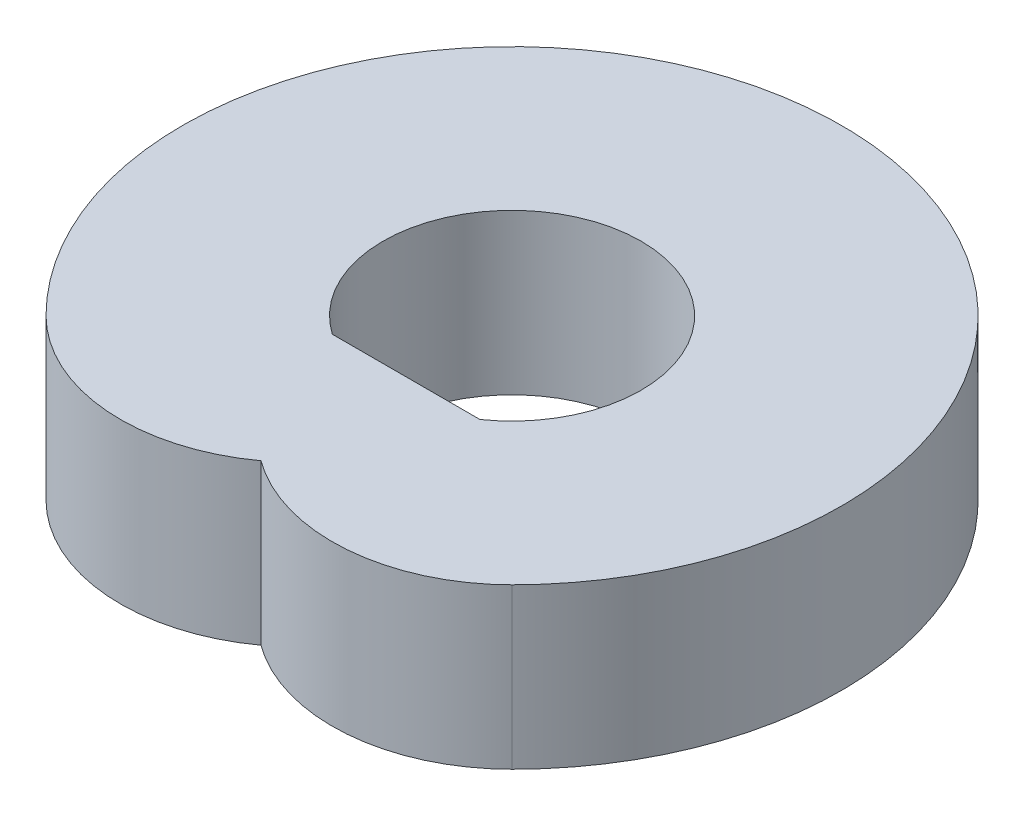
ISO-10303-21;
HEADER;
FILE_DESCRIPTION(('STEP AP214'),'2;1');
FILE_NAME('part.step','',(''),(''),'','','');
FILE_SCHEMA(('AUTOMOTIVE_DESIGN { 1 0 10303 214 1 1 1 1 }'));
ENDSEC;
DATA;
#1=APPLICATION_CONTEXT('core data for automotive mechanical design processes');
#2=APPLICATION_PROTOCOL_DEFINITION('international standard','automotive_design',2000,#1);
#3=PRODUCT_CONTEXT('',#1,'mechanical');
#4=PRODUCT('Part','Part','',(#3));
#5=PRODUCT_RELATED_PRODUCT_CATEGORY('part','',(#4));
#6=PRODUCT_DEFINITION_FORMATION('','',#4);
#7=PRODUCT_DEFINITION_CONTEXT('part definition',#1,'design');
#8=PRODUCT_DEFINITION('design','',#6,#7);
#9=PRODUCT_DEFINITION_SHAPE('','',#8);
#10=(LENGTH_UNIT() NAMED_UNIT(*) SI_UNIT(.MILLI.,.METRE.));
#11=(NAMED_UNIT(*) PLANE_ANGLE_UNIT() SI_UNIT($,.RADIAN.));
#12=(NAMED_UNIT(*) SI_UNIT($,.STERADIAN.) SOLID_ANGLE_UNIT());
#13=UNCERTAINTY_MEASURE_WITH_UNIT(LENGTH_MEASURE(1.E-05),#10,'distance_accuracy_value','');
#14=(GEOMETRIC_REPRESENTATION_CONTEXT(3) GLOBAL_UNCERTAINTY_ASSIGNED_CONTEXT((#13)) GLOBAL_UNIT_ASSIGNED_CONTEXT((#10,
#11,#12)) REPRESENTATION_CONTEXT('',''));
#15=CARTESIAN_POINT('',(0.,0.,0.));
#16=DIRECTION('',(0.,0.,1.));
#17=DIRECTION('',(1.,0.,0.));
#18=AXIS2_PLACEMENT_3D('',#15,#16,#17);
#19=CARTESIAN_POINT('',(132.582521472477,400.,132.582521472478));
#20=DIRECTION('',(0.,1.,0.));
#21=DIRECTION('',(0.,0.,1.));
#22=AXIS2_PLACEMENT_3D('',#19,#20,#21);
#23=PLANE('',#22);
#24=CARTESIAN_POINT('',(265.165042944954,400.,265.165042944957));
#25=DIRECTION('',(0.,1.,0.));
#26=DIRECTION('',(0.,0.,1.));
#27=AXIS2_PLACEMENT_3D('',#24,#25,#26);
#28=CIRCLE('',#27,449.999999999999);
#29=CARTESIAN_POINT('',(1.83186799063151E-12,400.,628.741032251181));
#30=VERTEX_POINT('',#29);
#31=CARTESIAN_POINT('',(583.363094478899,400.,583.363094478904));
#32=VERTEX_POINT('',#31);
#33=EDGE_CURVE('E98',#30,#32,#28,.T.);
#34=ORIENTED_EDGE('',*,*,#33,.T.);
#35=CARTESIAN_POINT('',(0.,400.,0.));
#36=DIRECTION('',(0.,1.,0.));
#37=DIRECTION('',(0.,0.,1.));
#38=AXIS2_PLACEMENT_3D('',#35,#36,#37);
#39=CIRCLE('',#38,825.);
#40=CARTESIAN_POINT('',(-583.363094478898,400.,583.363094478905));
#41=VERTEX_POINT('',#40);
#42=EDGE_CURVE('E101',#32,#41,#39,.T.);
#43=ORIENTED_EDGE('',*,*,#42,.T.);
#44=CARTESIAN_POINT('',(-265.165042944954,400.,265.165042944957));
#45=DIRECTION('',(0.,1.,0.));
#46=DIRECTION('',(0.,0.,1.));
#47=AXIS2_PLACEMENT_3D('',#44,#45,#46);
#48=CIRCLE('',#47,450.);
#49=EDGE_CURVE('E104',#41,#30,#48,.T.);
#50=ORIENTED_EDGE('',*,*,#49,.T.);
#51=EDGE_LOOP('',(#34,#43,#50));
#52=FACE_BOUND('',#51,.T.);
#53=DIRECTION('',(1.,0.,0.));
#54=VECTOR('',#53,1.);
#55=CARTESIAN_POINT('',(184.83495705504,400.,265.165042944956));
#56=LINE('',#55,#54);
#57=CARTESIAN_POINT('',(-184.834957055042,400.,265.165042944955));
#58=VERTEX_POINT('',#57);
#59=CARTESIAN_POINT('',(184.83495705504,400.,265.165042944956));
#60=VERTEX_POINT('',#59);
#61=EDGE_CURVE('E81',#58,#60,#56,.T.);
#62=ORIENTED_EDGE('',*,*,#61,.F.);
#63=CARTESIAN_POINT('',(0.,400.,0.));
#64=DIRECTION('',(0.,1.,0.));
#65=DIRECTION('',(0.,0.,1.));
#66=AXIS2_PLACEMENT_3D('',#63,#64,#65);
#67=CIRCLE('',#66,323.228187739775);
#68=EDGE_CURVE('E87',#60,#58,#67,.T.);
#69=ORIENTED_EDGE('',*,*,#68,.F.);
#70=EDGE_LOOP('',(#62,#69));
#71=FACE_BOUND('',#70,.T.);
#72=ADVANCED_FACE('F35',(#52,#71),#23,.T.);
#73=CARTESIAN_POINT('',(132.582521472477,0.,132.582521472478));
#74=DIRECTION('',(0.,1.,0.));
#75=DIRECTION('',(0.,0.,1.));
#76=AXIS2_PLACEMENT_3D('',#73,#74,#75);
#77=PLANE('',#76);
#78=CARTESIAN_POINT('',(265.165042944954,0.,265.165042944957));
#79=DIRECTION('',(0.,1.,0.));
#80=DIRECTION('',(0.,0.,1.));
#81=AXIS2_PLACEMENT_3D('',#78,#79,#80);
#82=CIRCLE('',#81,449.999999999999);
#83=CARTESIAN_POINT('',(1.83186799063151E-12,0.,628.741032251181));
#84=VERTEX_POINT('',#83);
#85=CARTESIAN_POINT('',(583.363094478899,0.,583.363094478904));
#86=VERTEX_POINT('',#85);
#87=EDGE_CURVE('E97',#84,#86,#82,.T.);
#88=ORIENTED_EDGE('',*,*,#87,.F.);
#89=CARTESIAN_POINT('',(-265.165042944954,0.,265.165042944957));
#90=DIRECTION('',(0.,1.,0.));
#91=DIRECTION('',(0.,0.,1.));
#92=AXIS2_PLACEMENT_3D('',#89,#90,#91);
#93=CIRCLE('',#92,450.);
#94=CARTESIAN_POINT('',(-583.363094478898,0.,583.363094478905));
#95=VERTEX_POINT('',#94);
#96=EDGE_CURVE('E102',#95,#84,#93,.T.);
#97=ORIENTED_EDGE('',*,*,#96,.F.);
#98=CARTESIAN_POINT('',(0.,0.,0.));
#99=DIRECTION('',(0.,1.,0.));
#100=DIRECTION('',(0.,0.,1.));
#101=AXIS2_PLACEMENT_3D('',#98,#99,#100);
#102=CIRCLE('',#101,825.);
#103=EDGE_CURVE('E109',#86,#95,#102,.T.);
#104=ORIENTED_EDGE('',*,*,#103,.F.);
#105=EDGE_LOOP('',(#88,#97,#104));
#106=FACE_BOUND('',#105,.T.);
#107=CARTESIAN_POINT('',(0.,0.,0.));
#108=DIRECTION('',(0.,1.,0.));
#109=DIRECTION('',(0.,0.,1.));
#110=AXIS2_PLACEMENT_3D('',#107,#108,#109);
#111=CIRCLE('',#110,323.228187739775);
#112=CARTESIAN_POINT('',(184.83495705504,0.,265.165042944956));
#113=VERTEX_POINT('',#112);
#114=CARTESIAN_POINT('',(-184.834957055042,0.,265.165042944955));
#115=VERTEX_POINT('',#114);
#116=EDGE_CURVE('E57',#113,#115,#111,.T.);
#117=ORIENTED_EDGE('',*,*,#116,.T.);
#118=DIRECTION('',(1.,0.,0.));
#119=VECTOR('',#118,1.);
#120=CARTESIAN_POINT('',(184.83495705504,0.,265.165042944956));
#121=LINE('',#120,#119);
#122=EDGE_CURVE('E91',#115,#113,#121,.T.);
#123=ORIENTED_EDGE('',*,*,#122,.T.);
#124=EDGE_LOOP('',(#117,#123));
#125=FACE_BOUND('',#124,.T.);
#126=ADVANCED_FACE('F123',(#106,#125),#77,.F.);
#127=CARTESIAN_POINT('',(265.165042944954,400.,265.165042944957));
#128=DIRECTION('',(0.,-1.,0.));
#129=DIRECTION('',(0.,0.,-1.));
#130=AXIS2_PLACEMENT_3D('',#127,#128,#129);
#131=CYLINDRICAL_SURFACE('',#130,449.999999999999);
#132=ORIENTED_EDGE('',*,*,#87,.T.);
#133=DIRECTION('',(0.,-1.,0.));
#134=VECTOR('',#133,1.);
#135=CARTESIAN_POINT('',(583.363094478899,400.,583.363094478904));
#136=LINE('',#135,#134);
#137=EDGE_CURVE('E11',#32,#86,#136,.T.);
#138=ORIENTED_EDGE('',*,*,#137,.F.);
#139=ORIENTED_EDGE('',*,*,#33,.F.);
#140=DIRECTION('',(0.,-1.,0.));
#141=VECTOR('',#140,1.);
#142=CARTESIAN_POINT('',(1.83186799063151E-12,400.,628.741032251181));
#143=LINE('',#142,#141);
#144=EDGE_CURVE('E106',#30,#84,#143,.T.);
#145=ORIENTED_EDGE('',*,*,#144,.T.);
#146=EDGE_LOOP('',(#132,#138,#139,#145));
#147=FACE_BOUND('',#146,.T.);
#148=ADVANCED_FACE('F37',(#147),#131,.T.);
#149=CARTESIAN_POINT('',(0.,400.,0.));
#150=DIRECTION('',(0.,-1.,0.));
#151=DIRECTION('',(0.,0.,-1.));
#152=AXIS2_PLACEMENT_3D('',#149,#150,#151);
#153=CYLINDRICAL_SURFACE('',#152,825.);
#154=ORIENTED_EDGE('',*,*,#103,.T.);
#155=DIRECTION('',(0.,-1.,0.));
#156=VECTOR('',#155,1.);
#157=CARTESIAN_POINT('',(-583.363094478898,400.,583.363094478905));
#158=LINE('',#157,#156);
#159=EDGE_CURVE('E43',#41,#95,#158,.T.);
#160=ORIENTED_EDGE('',*,*,#159,.F.);
#161=ORIENTED_EDGE('',*,*,#42,.F.);
#162=ORIENTED_EDGE('',*,*,#137,.T.);
#163=EDGE_LOOP('',(#154,#160,#161,#162));
#164=FACE_BOUND('',#163,.T.);
#165=ADVANCED_FACE('F129',(#164),#153,.T.);
#166=CARTESIAN_POINT('',(-265.165042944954,400.,265.165042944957));
#167=DIRECTION('',(0.,-1.,0.));
#168=DIRECTION('',(0.,0.,-1.));
#169=AXIS2_PLACEMENT_3D('',#166,#167,#168);
#170=CYLINDRICAL_SURFACE('',#169,450.);
#171=ORIENTED_EDGE('',*,*,#96,.T.);
#172=ORIENTED_EDGE('',*,*,#144,.F.);
#173=ORIENTED_EDGE('',*,*,#49,.F.);
#174=ORIENTED_EDGE('',*,*,#159,.T.);
#175=EDGE_LOOP('',(#171,#172,#173,#174));
#176=FACE_BOUND('',#175,.T.);
#177=ADVANCED_FACE('F118',(#176),#170,.T.);
#178=CARTESIAN_POINT('',(0.,400.,0.));
#179=DIRECTION('',(0.,-1.,0.));
#180=DIRECTION('',(0.,0.,-1.));
#181=AXIS2_PLACEMENT_3D('',#178,#179,#180);
#182=CYLINDRICAL_SURFACE('',#181,323.228187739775);
#183=ORIENTED_EDGE('',*,*,#116,.F.);
#184=DIRECTION('',(0.,-1.,0.));
#185=VECTOR('',#184,1.);
#186=CARTESIAN_POINT('',(184.83495705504,400.,265.165042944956));
#187=LINE('',#186,#185);
#188=EDGE_CURVE('E83',#60,#113,#187,.T.);
#189=ORIENTED_EDGE('',*,*,#188,.F.);
#190=ORIENTED_EDGE('',*,*,#68,.T.);
#191=DIRECTION('',(0.,-1.,0.));
#192=VECTOR('',#191,1.);
#193=CARTESIAN_POINT('',(-184.834957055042,400.,265.165042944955));
#194=LINE('',#193,#192);
#195=EDGE_CURVE('E50',#58,#115,#194,.T.);
#196=ORIENTED_EDGE('',*,*,#195,.T.);
#197=EDGE_LOOP('',(#183,#189,#190,#196));
#198=FACE_BOUND('',#197,.T.);
#199=ADVANCED_FACE('F89',(#198),#182,.F.);
#200=CARTESIAN_POINT('',(184.83495705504,400.,265.165042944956));
#201=DIRECTION('',(0.,0.,-1.));
#202=DIRECTION('',(-1.,0.,0.));
#203=AXIS2_PLACEMENT_3D('',#200,#201,#202);
#204=PLANE('',#203);
#205=ORIENTED_EDGE('',*,*,#122,.F.);
#206=ORIENTED_EDGE('',*,*,#195,.F.);
#207=ORIENTED_EDGE('',*,*,#61,.T.);
#208=ORIENTED_EDGE('',*,*,#188,.T.);
#209=EDGE_LOOP('',(#205,#206,#207,#208));
#210=FACE_BOUND('',#209,.T.);
#211=ADVANCED_FACE('F82',(#210),#204,.T.);
#212=CLOSED_SHELL('',(#72,#126,#148,#165,#177,#199,#211));
#213=MANIFOLD_SOLID_BREP('B2',#212);
#214=ADVANCED_BREP_SHAPE_REPRESENTATION('',(#18,#213),#14);
#215=SHAPE_DEFINITION_REPRESENTATION(#9,#214);
ENDSEC;
END-ISO-10303-21;
